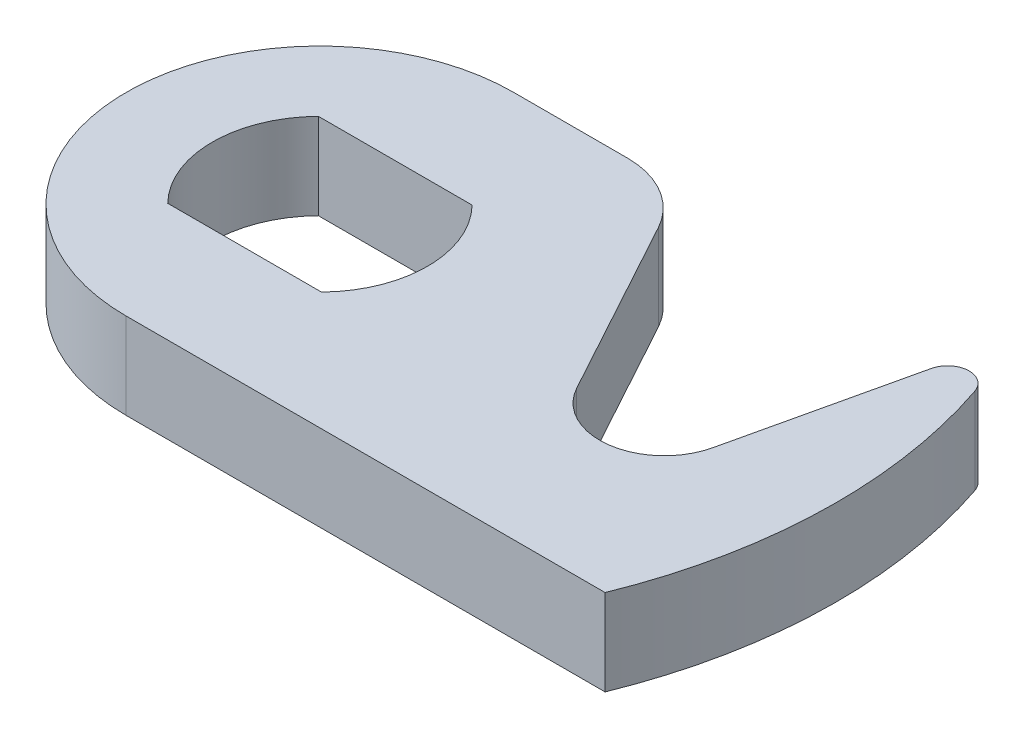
ISO-10303-21;
HEADER;
FILE_DESCRIPTION(('STEP AP214'),'2;1');
FILE_NAME('part.step','',(''),(''),'','','');
FILE_SCHEMA(('AUTOMOTIVE_DESIGN { 1 0 10303 214 1 1 1 1 }'));
ENDSEC;
DATA;
#1=APPLICATION_CONTEXT('core data for automotive mechanical design processes');
#2=APPLICATION_PROTOCOL_DEFINITION('international standard','automotive_design',2000,#1);
#3=PRODUCT_CONTEXT('',#1,'mechanical');
#4=PRODUCT('Part','Part','',(#3));
#5=PRODUCT_RELATED_PRODUCT_CATEGORY('part','',(#4));
#6=PRODUCT_DEFINITION_FORMATION('','',#4);
#7=PRODUCT_DEFINITION_CONTEXT('part definition',#1,'design');
#8=PRODUCT_DEFINITION('design','',#6,#7);
#9=PRODUCT_DEFINITION_SHAPE('','',#8);
#10=(LENGTH_UNIT() NAMED_UNIT(*) SI_UNIT(.MILLI.,.METRE.));
#11=(NAMED_UNIT(*) PLANE_ANGLE_UNIT() SI_UNIT($,.RADIAN.));
#12=(NAMED_UNIT(*) SI_UNIT($,.STERADIAN.) SOLID_ANGLE_UNIT());
#13=UNCERTAINTY_MEASURE_WITH_UNIT(LENGTH_MEASURE(1.E-05),#10,'distance_accuracy_value','');
#14=(GEOMETRIC_REPRESENTATION_CONTEXT(3) GLOBAL_UNCERTAINTY_ASSIGNED_CONTEXT((#13)) GLOBAL_UNIT_ASSIGNED_CONTEXT((#10,
#11,#12)) REPRESENTATION_CONTEXT('',''));
#15=CARTESIAN_POINT('',(0.,0.,0.));
#16=DIRECTION('',(0.,0.,1.));
#17=DIRECTION('',(1.,0.,0.));
#18=AXIS2_PLACEMENT_3D('',#15,#16,#17);
#19=CARTESIAN_POINT('',(22.832506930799,1.50000000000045,18.6255077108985));
#20=DIRECTION('',(0.,-1.,0.));
#21=DIRECTION('',(0.,0.,-1.));
#22=AXIS2_PLACEMENT_3D('',#19,#20,#21);
#23=PLANE('',#22);
#24=CARTESIAN_POINT('',(10.5,1.50000000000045,21.));
#25=DIRECTION('',(0.,-1.,0.));
#26=DIRECTION('',(1.,0.,0.));
#27=AXIS2_PLACEMENT_3D('',#24,#25,#26);
#28=CIRCLE('',#27,5.);
#29=CARTESIAN_POINT('',(6.92928578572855,1.50000000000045,24.5));
#30=VERTEX_POINT('',#29);
#31=CARTESIAN_POINT('',(6.92928578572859,1.50000000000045,17.5));
#32=VERTEX_POINT('',#31);
#33=EDGE_CURVE('E171',#30,#32,#28,.T.);
#34=ORIENTED_EDGE('',*,*,#33,.T.);
#35=DIRECTION('',(-1.,0.,0.));
#36=VECTOR('',#35,1.);
#37=CARTESIAN_POINT('',(14.0707142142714,1.50000000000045,17.5));
#38=LINE('',#37,#36);
#39=CARTESIAN_POINT('',(14.0707142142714,1.50000000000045,17.5));
#40=VERTEX_POINT('',#39);
#41=EDGE_CURVE('E192',#32,#40,#38,.F.);
#42=ORIENTED_EDGE('',*,*,#41,.T.);
#43=CARTESIAN_POINT('',(10.5,1.50000000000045,21.));
#44=DIRECTION('',(0.,-1.,0.));
#45=DIRECTION('',(1.,0.,0.));
#46=AXIS2_PLACEMENT_3D('',#43,#44,#45);
#47=CIRCLE('',#46,5.00000000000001);
#48=CARTESIAN_POINT('',(14.0707142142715,1.50000000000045,24.5));
#49=VERTEX_POINT('',#48);
#50=EDGE_CURVE('E174',#40,#49,#47,.T.);
#51=ORIENTED_EDGE('',*,*,#50,.T.);
#52=DIRECTION('',(1.,0.,0.));
#53=VECTOR('',#52,1.);
#54=CARTESIAN_POINT('',(6.92928578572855,1.50000000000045,24.5));
#55=LINE('',#54,#53);
#56=EDGE_CURVE('E129',#49,#30,#55,.F.);
#57=ORIENTED_EDGE('',*,*,#56,.T.);
#58=EDGE_LOOP('',(#34,#42,#51,#57));
#59=FACE_BOUND('',#58,.T.);
#60=CARTESIAN_POINT('',(32.2863227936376,1.50000000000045,13.6273383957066));
#61=DIRECTION('',(0.,-1.,0.));
#62=DIRECTION('',(1.,0.,0.));
#63=AXIS2_PLACEMENT_3D('',#60,#61,#62);
#64=CIRCLE('',#63,1.00000000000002);
#65=CARTESIAN_POINT('',(31.3114126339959,1.50000000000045,13.4047396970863));
#66=VERTEX_POINT('',#65);
#67=CARTESIAN_POINT('',(33.2335542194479,1.50000000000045,13.3067878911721));
#68=VERTEX_POINT('',#67);
#69=EDGE_CURVE('E179',#66,#68,#64,.T.);
#70=ORIENTED_EDGE('',*,*,#69,.F.);
#71=DIRECTION('',(-0.222598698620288,0.,0.974910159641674));
#72=VECTOR('',#71,1.);
#73=CARTESIAN_POINT('',(31.3114126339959,1.50000000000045,13.4047396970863));
#74=LINE('',#73,#72);
#75=CARTESIAN_POINT('',(29.424730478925,1.50000000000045,21.6677960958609));
#76=VERTEX_POINT('',#75);
#77=EDGE_CURVE('E139',#76,#66,#74,.F.);
#78=ORIENTED_EDGE('',*,*,#77,.F.);
#79=CARTESIAN_POINT('',(26.4999999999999,1.50000000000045,21.));
#80=DIRECTION('',(0.,-1.,0.));
#81=DIRECTION('',(1.,0.,0.));
#82=AXIS2_PLACEMENT_3D('',#79,#80,#81);
#83=CIRCLE('',#82,3.00000000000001);
#84=CARTESIAN_POINT('',(23.8670311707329,1.50000000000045,22.4378717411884));
#85=VERTEX_POINT('',#84);
#86=EDGE_CURVE('E146',#76,#85,#83,.T.);
#87=ORIENTED_EDGE('',*,*,#86,.T.);
#88=DIRECTION('',(-0.479290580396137,0.,-0.877656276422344));
#89=VECTOR('',#88,1.);
#90=CARTESIAN_POINT('',(23.867031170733,1.50000000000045,22.4378717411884));
#91=LINE('',#90,#89);
#92=CARTESIAN_POINT('',(19.3043233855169,1.50000000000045,14.0828376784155));
#93=VERTEX_POINT('',#92);
#94=EDGE_CURVE('E143',#93,#85,#91,.F.);
#95=ORIENTED_EDGE('',*,*,#94,.F.);
#96=CARTESIAN_POINT('',(15.7936982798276,1.50000000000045,16.));
#97=DIRECTION('',(0.,-1.,0.));
#98=DIRECTION('',(1.,0.,0.));
#99=AXIS2_PLACEMENT_3D('',#96,#97,#98);
#100=CIRCLE('',#99,3.99999999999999);
#101=CARTESIAN_POINT('',(15.7936982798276,1.50000000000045,12.));
#102=VERTEX_POINT('',#101);
#103=EDGE_CURVE('E182',#102,#93,#100,.T.);
#104=ORIENTED_EDGE('',*,*,#103,.F.);
#105=DIRECTION('',(-1.,0.,0.));
#106=VECTOR('',#105,1.);
#107=CARTESIAN_POINT('',(15.7936982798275,1.50000000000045,12.));
#108=LINE('',#107,#106);
#109=CARTESIAN_POINT('',(10.5,1.50000000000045,12.));
#110=VERTEX_POINT('',#109);
#111=EDGE_CURVE('E117',#110,#102,#108,.F.);
#112=ORIENTED_EDGE('',*,*,#111,.F.);
#113=CARTESIAN_POINT('',(10.5,1.50000000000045,21.));
#114=DIRECTION('',(0.,-1.,0.));
#115=DIRECTION('',(1.,0.,0.));
#116=AXIS2_PLACEMENT_3D('',#113,#114,#115);
#117=CIRCLE('',#116,9.);
#118=CARTESIAN_POINT('',(10.5,1.50000000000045,30.));
#119=VERTEX_POINT('',#118);
#120=EDGE_CURVE('E19',#119,#110,#117,.T.);
#121=ORIENTED_EDGE('',*,*,#120,.F.);
#122=DIRECTION('',(1.,0.,0.));
#123=VECTOR('',#122,1.);
#124=CARTESIAN_POINT('',(10.5,1.50000000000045,30.));
#125=LINE('',#124,#123);
#126=CARTESIAN_POINT('',(32.748595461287,1.50000000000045,30.));
#127=VERTEX_POINT('',#126);
#128=EDGE_CURVE('E114',#127,#119,#125,.F.);
#129=ORIENTED_EDGE('',*,*,#128,.F.);
#130=CARTESIAN_POINT('',(10.4999999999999,1.50000000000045,21.0000000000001));
#131=DIRECTION('',(0.,-1.,0.));
#132=DIRECTION('',(1.,0.,0.));
#133=AXIS2_PLACEMENT_3D('',#130,#131,#132);
#134=CIRCLE('',#133,24.0000000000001);
#135=EDGE_CURVE('E134',#68,#127,#134,.T.);
#136=ORIENTED_EDGE('',*,*,#135,.F.);
#137=EDGE_LOOP('',(#70,#78,#87,#95,#104,#112,#121,#129,#136));
#138=FACE_BOUND('',#137,.T.);
#139=ADVANCED_FACE('F16',(#59,#138),#23,.F.);
#140=CARTESIAN_POINT('',(10.5,1.50000000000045,21.));
#141=DIRECTION('',(0.,-1.,0.));
#142=DIRECTION('',(1.,0.,0.));
#143=AXIS2_PLACEMENT_3D('',#140,#141,#142);
#144=CYLINDRICAL_SURFACE('',#143,9.);
#145=DIRECTION('',(0.,1.,0.));
#146=VECTOR('',#145,1.);
#147=CARTESIAN_POINT('',(10.5,1.50000000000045,12.));
#148=LINE('',#147,#146);
#149=CARTESIAN_POINT('',(10.5,-2.49999999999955,12.));
#150=VERTEX_POINT('',#149);
#151=EDGE_CURVE('E120',#150,#110,#148,.T.);
#152=ORIENTED_EDGE('',*,*,#151,.F.);
#153=CARTESIAN_POINT('',(10.5,-2.49999999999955,21.));
#154=DIRECTION('',(0.,-1.,0.));
#155=DIRECTION('',(1.,0.,0.));
#156=AXIS2_PLACEMENT_3D('',#153,#154,#155);
#157=CIRCLE('',#156,9.);
#158=CARTESIAN_POINT('',(10.5,-2.49999999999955,30.));
#159=VERTEX_POINT('',#158);
#160=EDGE_CURVE('E125',#159,#150,#157,.T.);
#161=ORIENTED_EDGE('',*,*,#160,.F.);
#162=DIRECTION('',(0.,1.,0.));
#163=VECTOR('',#162,1.);
#164=CARTESIAN_POINT('',(10.5,1.50000000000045,30.));
#165=LINE('',#164,#163);
#166=EDGE_CURVE('E122',#119,#159,#165,.F.);
#167=ORIENTED_EDGE('',*,*,#166,.F.);
#168=ORIENTED_EDGE('',*,*,#120,.T.);
#169=EDGE_LOOP('',(#152,#161,#167,#168));
#170=FACE_BOUND('',#169,.T.);
#171=ADVANCED_FACE('F123',(#170),#144,.T.);
#172=CARTESIAN_POINT('',(15.7936982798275,1.50000000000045,12.));
#173=DIRECTION('',(0.,0.,-1.));
#174=DIRECTION('',(-1.,0.,0.));
#175=AXIS2_PLACEMENT_3D('',#172,#173,#174);
#176=PLANE('',#175);
#177=DIRECTION('',(0.,-1.,0.));
#178=VECTOR('',#177,1.);
#179=CARTESIAN_POINT('',(15.7936982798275,1.50000000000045,12.));
#180=LINE('',#179,#178);
#181=CARTESIAN_POINT('',(15.7936982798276,-2.49999999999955,12.));
#182=VERTEX_POINT('',#181);
#183=EDGE_CURVE('E148',#182,#102,#180,.F.);
#184=ORIENTED_EDGE('',*,*,#183,.F.);
#185=DIRECTION('',(1.,0.,0.));
#186=VECTOR('',#185,1.);
#187=CARTESIAN_POINT('',(33.233554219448,-2.49999999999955,12.));
#188=LINE('',#187,#186);
#189=EDGE_CURVE('E169',#150,#182,#188,.T.);
#190=ORIENTED_EDGE('',*,*,#189,.F.);
#191=ORIENTED_EDGE('',*,*,#151,.T.);
#192=ORIENTED_EDGE('',*,*,#111,.T.);
#193=EDGE_LOOP('',(#184,#190,#191,#192));
#194=FACE_BOUND('',#193,.T.);
#195=ADVANCED_FACE('F343',(#194),#176,.T.);
#196=CARTESIAN_POINT('',(15.7936982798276,1.50000000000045,16.));
#197=DIRECTION('',(0.,-1.,0.));
#198=DIRECTION('',(1.,0.,0.));
#199=AXIS2_PLACEMENT_3D('',#196,#197,#198);
#200=CYLINDRICAL_SURFACE('',#199,3.99999999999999);
#201=DIRECTION('',(0.,1.,0.));
#202=VECTOR('',#201,1.);
#203=CARTESIAN_POINT('',(19.3043233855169,1.50000000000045,14.0828376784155));
#204=LINE('',#203,#202);
#205=CARTESIAN_POINT('',(19.3043233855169,-2.49999999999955,14.0828376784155));
#206=VERTEX_POINT('',#205);
#207=EDGE_CURVE('E147',#206,#93,#204,.T.);
#208=ORIENTED_EDGE('',*,*,#207,.F.);
#209=CARTESIAN_POINT('',(15.7936982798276,-2.49999999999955,16.));
#210=DIRECTION('',(0.,-1.,0.));
#211=DIRECTION('',(1.,0.,0.));
#212=AXIS2_PLACEMENT_3D('',#209,#210,#211);
#213=CIRCLE('',#212,3.99999999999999);
#214=EDGE_CURVE('E166',#182,#206,#213,.T.);
#215=ORIENTED_EDGE('',*,*,#214,.F.);
#216=ORIENTED_EDGE('',*,*,#183,.T.);
#217=ORIENTED_EDGE('',*,*,#103,.T.);
#218=EDGE_LOOP('',(#208,#215,#216,#217));
#219=FACE_BOUND('',#218,.T.);
#220=ADVANCED_FACE('F336',(#219),#200,.T.);
#221=CARTESIAN_POINT('',(23.867031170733,1.50000000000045,22.4378717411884));
#222=DIRECTION('',(0.877656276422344,0.,-0.479290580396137));
#223=DIRECTION('',(-0.479290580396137,0.,-0.877656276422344));
#224=AXIS2_PLACEMENT_3D('',#221,#222,#223);
#225=PLANE('',#224);
#226=DIRECTION('',(0.,-1.,0.));
#227=VECTOR('',#226,1.);
#228=CARTESIAN_POINT('',(23.8670311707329,1.50000000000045,22.4378717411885));
#229=LINE('',#228,#227);
#230=CARTESIAN_POINT('',(23.8670311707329,-2.49999999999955,22.4378717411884));
#231=VERTEX_POINT('',#230);
#232=EDGE_CURVE('E181',#85,#231,#229,.T.);
#233=ORIENTED_EDGE('',*,*,#232,.T.);
#234=DIRECTION('',(0.479290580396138,0.,0.877656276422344));
#235=VECTOR('',#234,1.);
#236=CARTESIAN_POINT('',(19.3043233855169,-2.49999999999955,14.0828376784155));
#237=LINE('',#236,#235);
#238=EDGE_CURVE('E165',#206,#231,#237,.T.);
#239=ORIENTED_EDGE('',*,*,#238,.F.);
#240=ORIENTED_EDGE('',*,*,#207,.T.);
#241=ORIENTED_EDGE('',*,*,#94,.T.);
#242=EDGE_LOOP('',(#233,#239,#240,#241));
#243=FACE_BOUND('',#242,.T.);
#244=ADVANCED_FACE('F213',(#243),#225,.T.);
#245=CARTESIAN_POINT('',(26.4999999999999,1.50000000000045,21.));
#246=DIRECTION('',(0.,-1.,0.));
#247=DIRECTION('',(1.,0.,0.));
#248=AXIS2_PLACEMENT_3D('',#245,#246,#247);
#249=CYLINDRICAL_SURFACE('',#248,3.00000000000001);
#250=ORIENTED_EDGE('',*,*,#86,.F.);
#251=DIRECTION('',(0.,1.,0.));
#252=VECTOR('',#251,1.);
#253=CARTESIAN_POINT('',(29.424730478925,1.50000000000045,21.6677960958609));
#254=LINE('',#253,#252);
#255=CARTESIAN_POINT('',(29.424730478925,-2.49999999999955,21.6677960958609));
#256=VERTEX_POINT('',#255);
#257=EDGE_CURVE('E142',#256,#76,#254,.T.);
#258=ORIENTED_EDGE('',*,*,#257,.F.);
#259=CARTESIAN_POINT('',(26.4999999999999,-2.49999999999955,21.));
#260=DIRECTION('',(0.,-1.,0.));
#261=DIRECTION('',(1.,0.,0.));
#262=AXIS2_PLACEMENT_3D('',#259,#260,#261);
#263=CIRCLE('',#262,3.00000000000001);
#264=EDGE_CURVE('E162',#231,#256,#263,.F.);
#265=ORIENTED_EDGE('',*,*,#264,.F.);
#266=ORIENTED_EDGE('',*,*,#232,.F.);
#267=EDGE_LOOP('',(#250,#258,#265,#266));
#268=FACE_BOUND('',#267,.T.);
#269=ADVANCED_FACE('F216',(#268),#249,.F.);
#270=CARTESIAN_POINT('',(31.3114126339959,1.50000000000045,13.4047396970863));
#271=DIRECTION('',(-0.974910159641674,0.,-0.222598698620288));
#272=DIRECTION('',(-0.222598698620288,0.,0.974910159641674));
#273=AXIS2_PLACEMENT_3D('',#270,#271,#272);
#274=PLANE('',#273);
#275=DIRECTION('',(0.,-1.,0.));
#276=VECTOR('',#275,1.);
#277=CARTESIAN_POINT('',(31.3114126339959,1.50000000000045,13.4047396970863));
#278=LINE('',#277,#276);
#279=CARTESIAN_POINT('',(31.3114126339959,-2.49999999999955,13.4047396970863));
#280=VERTEX_POINT('',#279);
#281=EDGE_CURVE('E141',#280,#66,#278,.F.);
#282=ORIENTED_EDGE('',*,*,#281,.F.);
#283=DIRECTION('',(0.222598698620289,0.,-0.974910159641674));
#284=VECTOR('',#283,1.);
#285=CARTESIAN_POINT('',(29.424730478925,-2.49999999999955,21.6677960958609));
#286=LINE('',#285,#284);
#287=EDGE_CURVE('E161',#256,#280,#286,.T.);
#288=ORIENTED_EDGE('',*,*,#287,.F.);
#289=ORIENTED_EDGE('',*,*,#257,.T.);
#290=ORIENTED_EDGE('',*,*,#77,.T.);
#291=EDGE_LOOP('',(#282,#288,#289,#290));
#292=FACE_BOUND('',#291,.T.);
#293=ADVANCED_FACE('F250',(#292),#274,.T.);
#294=CARTESIAN_POINT('',(32.2863227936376,1.50000000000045,13.6273383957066));
#295=DIRECTION('',(0.,-1.,0.));
#296=DIRECTION('',(1.,0.,0.));
#297=AXIS2_PLACEMENT_3D('',#294,#295,#296);
#298=CYLINDRICAL_SURFACE('',#297,1.00000000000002);
#299=DIRECTION('',(0.,-1.,0.));
#300=VECTOR('',#299,1.);
#301=CARTESIAN_POINT('',(33.233554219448,1.50000000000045,13.3067878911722));
#302=LINE('',#301,#300);
#303=CARTESIAN_POINT('',(33.233554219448,-2.49999999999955,13.3067878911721));
#304=VERTEX_POINT('',#303);
#305=EDGE_CURVE('E178',#304,#68,#302,.F.);
#306=ORIENTED_EDGE('',*,*,#305,.F.);
#307=CARTESIAN_POINT('',(32.2863227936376,-2.49999999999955,13.6273383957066));
#308=DIRECTION('',(0.,-1.,0.));
#309=DIRECTION('',(1.,0.,0.));
#310=AXIS2_PLACEMENT_3D('',#307,#308,#309);
#311=CIRCLE('',#310,1.00000000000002);
#312=EDGE_CURVE('E158',#280,#304,#311,.T.);
#313=ORIENTED_EDGE('',*,*,#312,.F.);
#314=ORIENTED_EDGE('',*,*,#281,.T.);
#315=ORIENTED_EDGE('',*,*,#69,.T.);
#316=EDGE_LOOP('',(#306,#313,#314,#315));
#317=FACE_BOUND('',#316,.T.);
#318=ADVANCED_FACE('F248',(#317),#298,.T.);
#319=CARTESIAN_POINT('',(10.4999999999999,1.50000000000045,21.0000000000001));
#320=DIRECTION('',(0.,-1.,0.));
#321=DIRECTION('',(1.,0.,0.));
#322=AXIS2_PLACEMENT_3D('',#319,#320,#321);
#323=CYLINDRICAL_SURFACE('',#322,24.0000000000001);
#324=DIRECTION('',(0.,1.,0.));
#325=VECTOR('',#324,1.);
#326=CARTESIAN_POINT('',(32.748595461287,1.50000000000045,30.));
#327=LINE('',#326,#325);
#328=CARTESIAN_POINT('',(32.748595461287,-2.49999999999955,30.));
#329=VERTEX_POINT('',#328);
#330=EDGE_CURVE('E132',#329,#127,#327,.T.);
#331=ORIENTED_EDGE('',*,*,#330,.F.);
#332=CARTESIAN_POINT('',(10.4999999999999,-2.49999999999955,21.0000000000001));
#333=DIRECTION('',(0.,-1.,0.));
#334=DIRECTION('',(1.,0.,0.));
#335=AXIS2_PLACEMENT_3D('',#332,#333,#334);
#336=CIRCLE('',#335,24.0000000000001);
#337=EDGE_CURVE('E154',#304,#329,#336,.T.);
#338=ORIENTED_EDGE('',*,*,#337,.F.);
#339=ORIENTED_EDGE('',*,*,#305,.T.);
#340=ORIENTED_EDGE('',*,*,#135,.T.);
#341=EDGE_LOOP('',(#331,#338,#339,#340));
#342=FACE_BOUND('',#341,.T.);
#343=ADVANCED_FACE('F245',(#342),#323,.T.);
#344=CARTESIAN_POINT('',(10.5,1.50000000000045,30.));
#345=DIRECTION('',(0.,0.,1.));
#346=DIRECTION('',(1.,0.,0.));
#347=AXIS2_PLACEMENT_3D('',#344,#345,#346);
#348=PLANE('',#347);
#349=ORIENTED_EDGE('',*,*,#128,.T.);
#350=ORIENTED_EDGE('',*,*,#166,.T.);
#351=DIRECTION('',(1.,0.,0.));
#352=VECTOR('',#351,1.);
#353=CARTESIAN_POINT('',(33.233554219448,-2.49999999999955,30.0000000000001));
#354=LINE('',#353,#352);
#355=EDGE_CURVE('E157',#329,#159,#354,.F.);
#356=ORIENTED_EDGE('',*,*,#355,.F.);
#357=ORIENTED_EDGE('',*,*,#330,.T.);
#358=EDGE_LOOP('',(#349,#350,#356,#357));
#359=FACE_BOUND('',#358,.T.);
#360=ADVANCED_FACE('F131',(#359),#348,.T.);
#361=CARTESIAN_POINT('',(6.92928578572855,1.50000000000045,24.5));
#362=DIRECTION('',(0.,0.,1.));
#363=DIRECTION('',(1.,0.,0.));
#364=AXIS2_PLACEMENT_3D('',#361,#362,#363);
#365=PLANE('',#364);
#366=ORIENTED_EDGE('',*,*,#56,.F.);
#367=DIRECTION('',(0.,-1.,0.));
#368=VECTOR('',#367,1.);
#369=CARTESIAN_POINT('',(14.0707142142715,1.50000000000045,24.5));
#370=LINE('',#369,#368);
#371=CARTESIAN_POINT('',(14.0707142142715,-2.49999999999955,24.5));
#372=VERTEX_POINT('',#371);
#373=EDGE_CURVE('E176',#49,#372,#370,.T.);
#374=ORIENTED_EDGE('',*,*,#373,.T.);
#375=DIRECTION('',(1.,0.,0.));
#376=VECTOR('',#375,1.);
#377=CARTESIAN_POINT('',(33.233554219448,-2.49999999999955,24.5));
#378=LINE('',#377,#376);
#379=CARTESIAN_POINT('',(6.92928578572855,-2.49999999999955,24.5));
#380=VERTEX_POINT('',#379);
#381=EDGE_CURVE('E153',#380,#372,#378,.T.);
#382=ORIENTED_EDGE('',*,*,#381,.F.);
#383=DIRECTION('',(0.,-1.,0.));
#384=VECTOR('',#383,1.);
#385=CARTESIAN_POINT('',(6.92928578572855,1.50000000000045,24.5));
#386=LINE('',#385,#384);
#387=EDGE_CURVE('E173',#380,#30,#386,.F.);
#388=ORIENTED_EDGE('',*,*,#387,.T.);
#389=EDGE_LOOP('',(#366,#374,#382,#388));
#390=FACE_BOUND('',#389,.T.);
#391=ADVANCED_FACE('F230',(#390),#365,.F.);
#392=CARTESIAN_POINT('',(10.5,1.50000000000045,21.));
#393=DIRECTION('',(0.,-1.,0.));
#394=DIRECTION('',(1.,0.,0.));
#395=AXIS2_PLACEMENT_3D('',#392,#393,#394);
#396=CYLINDRICAL_SURFACE('',#395,5.00000000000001);
#397=ORIENTED_EDGE('',*,*,#50,.F.);
#398=DIRECTION('',(0.,1.,0.));
#399=VECTOR('',#398,1.);
#400=CARTESIAN_POINT('',(14.0707142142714,1.50000000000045,17.5));
#401=LINE('',#400,#399);
#402=CARTESIAN_POINT('',(14.0707142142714,-2.49999999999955,17.5));
#403=VERTEX_POINT('',#402);
#404=EDGE_CURVE('E193',#40,#403,#401,.F.);
#405=ORIENTED_EDGE('',*,*,#404,.T.);
#406=CARTESIAN_POINT('',(10.5,-2.49999999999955,21.));
#407=DIRECTION('',(0.,-1.,0.));
#408=DIRECTION('',(1.,0.,0.));
#409=AXIS2_PLACEMENT_3D('',#406,#407,#408);
#410=CIRCLE('',#409,5.00000000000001);
#411=EDGE_CURVE('E150',#372,#403,#410,.F.);
#412=ORIENTED_EDGE('',*,*,#411,.F.);
#413=ORIENTED_EDGE('',*,*,#373,.F.);
#414=EDGE_LOOP('',(#397,#405,#412,#413));
#415=FACE_BOUND('',#414,.T.);
#416=ADVANCED_FACE('F238',(#415),#396,.F.);
#417=CARTESIAN_POINT('',(14.0707142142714,1.50000000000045,17.5));
#418=DIRECTION('',(0.,0.,-1.));
#419=DIRECTION('',(-1.,0.,0.));
#420=AXIS2_PLACEMENT_3D('',#417,#418,#419);
#421=PLANE('',#420);
#422=ORIENTED_EDGE('',*,*,#41,.F.);
#423=DIRECTION('',(0.,-1.,0.));
#424=VECTOR('',#423,1.);
#425=CARTESIAN_POINT('',(6.9292857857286,1.50000000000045,17.5));
#426=LINE('',#425,#424);
#427=CARTESIAN_POINT('',(6.92928578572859,-2.49999999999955,17.5));
#428=VERTEX_POINT('',#427);
#429=EDGE_CURVE('E34',#32,#428,#426,.T.);
#430=ORIENTED_EDGE('',*,*,#429,.T.);
#431=DIRECTION('',(1.,0.,0.));
#432=VECTOR('',#431,1.);
#433=CARTESIAN_POINT('',(33.233554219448,-2.49999999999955,17.5));
#434=LINE('',#433,#432);
#435=EDGE_CURVE('E25',#403,#428,#434,.F.);
#436=ORIENTED_EDGE('',*,*,#435,.F.);
#437=ORIENTED_EDGE('',*,*,#404,.F.);
#438=EDGE_LOOP('',(#422,#430,#436,#437));
#439=FACE_BOUND('',#438,.T.);
#440=ADVANCED_FACE('F235',(#439),#421,.F.);
#441=CARTESIAN_POINT('',(10.5,1.50000000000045,21.));
#442=DIRECTION('',(0.,-1.,0.));
#443=DIRECTION('',(1.,0.,0.));
#444=AXIS2_PLACEMENT_3D('',#441,#442,#443);
#445=CYLINDRICAL_SURFACE('',#444,5.);
#446=ORIENTED_EDGE('',*,*,#33,.F.);
#447=ORIENTED_EDGE('',*,*,#387,.F.);
#448=CARTESIAN_POINT('',(10.5,-2.49999999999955,21.));
#449=DIRECTION('',(0.,-1.,0.));
#450=DIRECTION('',(1.,0.,0.));
#451=AXIS2_PLACEMENT_3D('',#448,#449,#450);
#452=CIRCLE('',#451,5.);
#453=EDGE_CURVE('E11',#428,#380,#452,.F.);
#454=ORIENTED_EDGE('',*,*,#453,.F.);
#455=ORIENTED_EDGE('',*,*,#429,.F.);
#456=EDGE_LOOP('',(#446,#447,#454,#455));
#457=FACE_BOUND('',#456,.T.);
#458=ADVANCED_FACE('F233',(#457),#445,.F.);
#459=CARTESIAN_POINT('',(33.233554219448,-2.49999999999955,13.3067878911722));
#460=DIRECTION('',(0.,-1.,0.));
#461=DIRECTION('',(0.,0.,-1.));
#462=AXIS2_PLACEMENT_3D('',#459,#460,#461);
#463=PLANE('',#462);
#464=ORIENTED_EDGE('',*,*,#435,.T.);
#465=ORIENTED_EDGE('',*,*,#453,.T.);
#466=ORIENTED_EDGE('',*,*,#381,.T.);
#467=ORIENTED_EDGE('',*,*,#411,.T.);
#468=EDGE_LOOP('',(#464,#465,#466,#467));
#469=FACE_BOUND('',#468,.T.);
#470=ORIENTED_EDGE('',*,*,#337,.T.);
#471=ORIENTED_EDGE('',*,*,#355,.T.);
#472=ORIENTED_EDGE('',*,*,#160,.T.);
#473=ORIENTED_EDGE('',*,*,#189,.T.);
#474=ORIENTED_EDGE('',*,*,#214,.T.);
#475=ORIENTED_EDGE('',*,*,#238,.T.);
#476=ORIENTED_EDGE('',*,*,#264,.T.);
#477=ORIENTED_EDGE('',*,*,#287,.T.);
#478=ORIENTED_EDGE('',*,*,#312,.T.);
#479=EDGE_LOOP('',(#470,#471,#472,#473,#474,#475,#476,#477,#478));
#480=FACE_BOUND('',#479,.T.);
#481=ADVANCED_FACE('F220',(#469,#480),#463,.T.);
#482=CLOSED_SHELL('',(#139,#171,#195,#220,#244,#269,#293,#318,#343,#360,#391,#416,#440,#458,#481));
#483=MANIFOLD_SOLID_BREP('B1',#482);
#484=ADVANCED_BREP_SHAPE_REPRESENTATION('',(#18,#483),#14);
#485=SHAPE_DEFINITION_REPRESENTATION(#9,#484);
ENDSEC;
END-ISO-10303-21;
